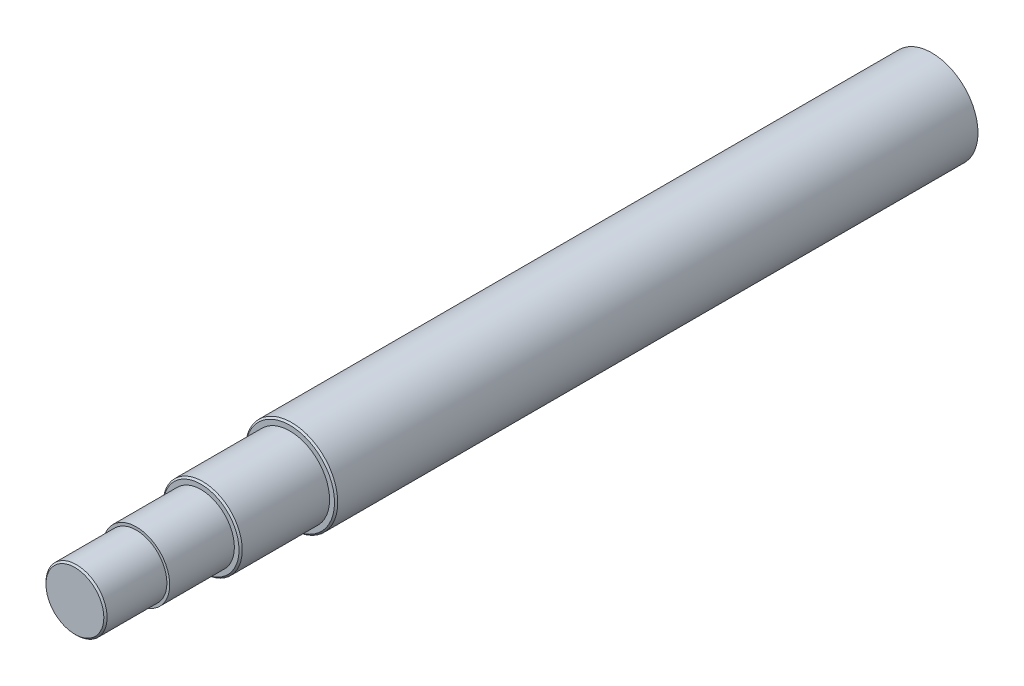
from build123d import *

# Parameters (mm, degrees)
SKETCH1_R           = 28.575
BOSS_EXTRUDE1_DEPTH = 530
SKETCH2_OUTSIDE_W   = 166.376
SKETCH2_OUTSIDE_H   = 166.376
SKETCH2_OUTSIDE_R   = 18.9
CUT_EXTRUDE1_DEPTH  = 38
SKETCH3_OUTSIDE_W   = 166.376
SKETCH3_OUTSIDE_H   = 166.376
SKETCH3_OUTSIDE_R   = 20.64
CUT_EXTRUDE2_DEPTH  = 40
SKETCH4_OUTSIDE_W   = 166.376
SKETCH4_OUTSIDE_H   = 166.376
SKETCH4_OUTSIDE_R   = 24.5
CUT_EXTRUDE3_DEPTH  = 55
SKETCH5_R           = 5
BOSS_EXTRUDE2_DEPTH = 5
CHAMFER1_SIZE       = 1


with BuildPart() as part:
    # Sketch1 → Boss-Extrude1 (new body)
    with BuildSketch(Plane.XY):
        Circle(SKETCH1_R)
    extrude(amount=BOSS_EXTRUDE1_DEPTH)

    # Sketch2 outside → Cut-Extrude1 (cut)
    with BuildSketch(Plane.XY.offset(530)):
        Rectangle(SKETCH2_OUTSIDE_W, SKETCH2_OUTSIDE_H)
        Circle(SKETCH2_OUTSIDE_R, mode=Mode.SUBTRACT)
    extrude(amount=-CUT_EXTRUDE1_DEPTH, mode=Mode.SUBTRACT)

    # Sketch3 outside → Cut-Extrude2 (cut)
    with BuildSketch(Plane.XY.offset(492)):
        Rectangle(SKETCH3_OUTSIDE_W, SKETCH3_OUTSIDE_H)
        Circle(SKETCH3_OUTSIDE_R, mode=Mode.SUBTRACT)
    extrude(amount=-CUT_EXTRUDE2_DEPTH, mode=Mode.SUBTRACT)

    # Sketch4 outside → Cut-Extrude3 (cut)
    with BuildSketch(Plane.XY.offset(452)):
        Rectangle(SKETCH4_OUTSIDE_W, SKETCH4_OUTSIDE_H)
        Circle(SKETCH4_OUTSIDE_R, mode=Mode.SUBTRACT)
    extrude(amount=-CUT_EXTRUDE3_DEPTH, mode=Mode.SUBTRACT)

    # Sketch5 → Boss-Extrude2 (add)
    with BuildSketch(Plane(origin=(0, 0, 0), x_dir=(-1, 0, 0), z_dir=(0, 0, -1))):
        Circle(SKETCH5_R)
    extrude(amount=BOSS_EXTRUDE2_DEPTH)

    # Chamfer1
    chamfer1_edges = [part.edges().sort_by_distance(p)[0] for p in [
        (-18.9, 0, 530),
        (-28.575, 0, 397),
        (-24.5, 0, 452),
    ]]
    chamfer(chamfer1_edges, length=CHAMFER1_SIZE)


solid = part.part
